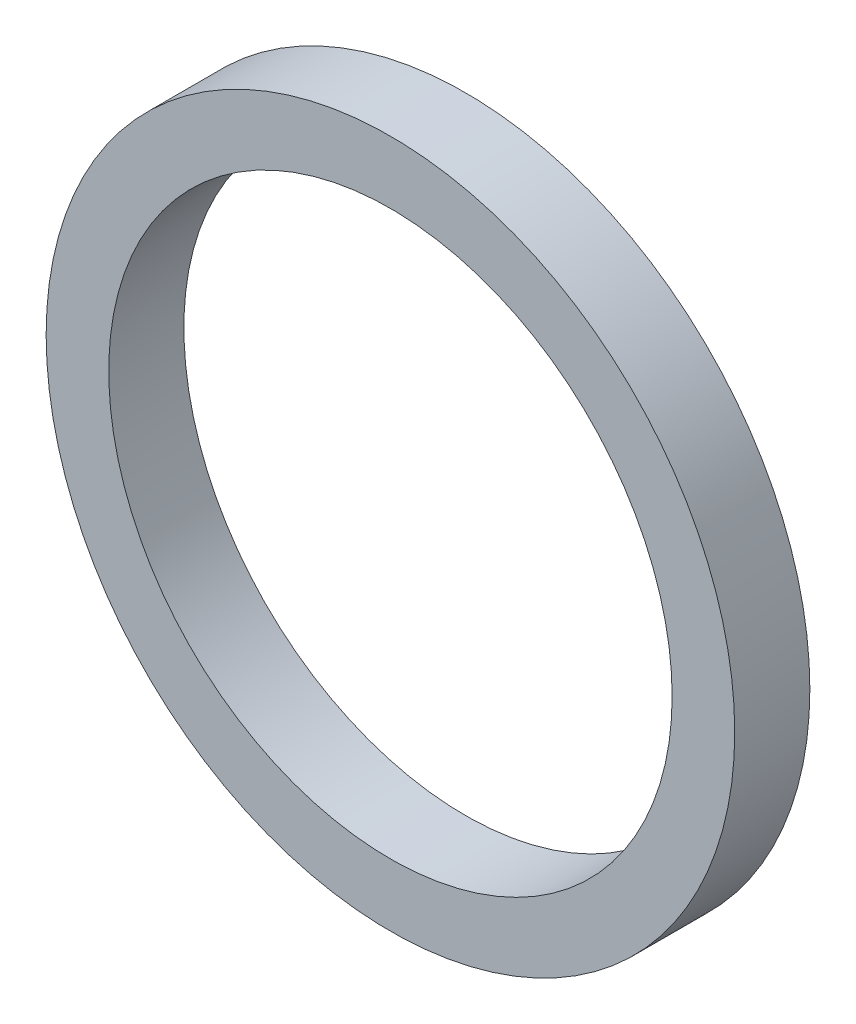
ISO-10303-21;
HEADER;
FILE_DESCRIPTION(('STEP AP214'),'2;1');
FILE_NAME('part.step','',(''),(''),'','','');
FILE_SCHEMA(('AUTOMOTIVE_DESIGN { 1 0 10303 214 1 1 1 1 }'));
ENDSEC;
DATA;
#1=APPLICATION_CONTEXT('core data for automotive mechanical design processes');
#2=APPLICATION_PROTOCOL_DEFINITION('international standard','automotive_design',2000,#1);
#3=PRODUCT_CONTEXT('',#1,'mechanical');
#4=PRODUCT('Part','Part','',(#3));
#5=PRODUCT_RELATED_PRODUCT_CATEGORY('part','',(#4));
#6=PRODUCT_DEFINITION_FORMATION('','',#4);
#7=PRODUCT_DEFINITION_CONTEXT('part definition',#1,'design');
#8=PRODUCT_DEFINITION('design','',#6,#7);
#9=PRODUCT_DEFINITION_SHAPE('','',#8);
#10=(LENGTH_UNIT() NAMED_UNIT(*) SI_UNIT(.MILLI.,.METRE.));
#11=(NAMED_UNIT(*) PLANE_ANGLE_UNIT() SI_UNIT($,.RADIAN.));
#12=(NAMED_UNIT(*) SI_UNIT($,.STERADIAN.) SOLID_ANGLE_UNIT());
#13=UNCERTAINTY_MEASURE_WITH_UNIT(LENGTH_MEASURE(1.E-05),#10,'distance_accuracy_value','');
#14=(GEOMETRIC_REPRESENTATION_CONTEXT(3) GLOBAL_UNCERTAINTY_ASSIGNED_CONTEXT((#13)) GLOBAL_UNIT_ASSIGNED_CONTEXT((#10,
#11,#12)) REPRESENTATION_CONTEXT('',''));
#15=CARTESIAN_POINT('',(0.,0.,0.));
#16=DIRECTION('',(0.,0.,1.));
#17=DIRECTION('',(1.,0.,0.));
#18=AXIS2_PLACEMENT_3D('',#15,#16,#17);
#19=CARTESIAN_POINT('',(0.,0.,0.));
#20=DIRECTION('',(0.,0.,1.));
#21=DIRECTION('',(1.,0.,0.));
#22=AXIS2_PLACEMENT_3D('',#19,#20,#21);
#23=PLANE('',#22);
#24=CARTESIAN_POINT('',(0.,0.,0.));
#25=DIRECTION('',(0.,0.,1.));
#26=DIRECTION('',(1.,0.,0.));
#27=AXIS2_PLACEMENT_3D('',#24,#25,#26);
#28=CIRCLE('',#27,22.5);
#29=CARTESIAN_POINT('',(22.5,0.,0.));
#30=VERTEX_POINT('',#29);
#31=EDGE_CURVE('E18',#30,#30,#28,.T.);
#32=ORIENTED_EDGE('',*,*,#31,.T.);
#33=EDGE_LOOP('',(#32));
#34=FACE_BOUND('',#33,.T.);
#35=CARTESIAN_POINT('',(0.,0.,0.));
#36=DIRECTION('',(0.,0.,1.));
#37=DIRECTION('',(1.,0.,0.));
#38=AXIS2_PLACEMENT_3D('',#35,#36,#37);
#39=CIRCLE('',#38,27.5);
#40=CARTESIAN_POINT('',(27.5,0.,0.));
#41=VERTEX_POINT('',#40);
#42=EDGE_CURVE('E10',#41,#41,#39,.T.);
#43=ORIENTED_EDGE('',*,*,#42,.F.);
#44=EDGE_LOOP('',(#43));
#45=FACE_BOUND('',#44,.T.);
#46=ADVANCED_FACE('F15',(#34,#45),#23,.F.);
#47=CARTESIAN_POINT('',(0.,0.,6.));
#48=DIRECTION('',(0.,0.,1.));
#49=DIRECTION('',(1.,0.,0.));
#50=AXIS2_PLACEMENT_3D('',#47,#48,#49);
#51=PLANE('',#50);
#52=CARTESIAN_POINT('',(0.,0.,6.));
#53=DIRECTION('',(0.,0.,1.));
#54=DIRECTION('',(1.,0.,0.));
#55=AXIS2_PLACEMENT_3D('',#52,#53,#54);
#56=CIRCLE('',#55,22.5);
#57=CARTESIAN_POINT('',(22.5,0.,6.));
#58=VERTEX_POINT('',#57);
#59=EDGE_CURVE('E34',#58,#58,#56,.T.);
#60=ORIENTED_EDGE('',*,*,#59,.F.);
#61=EDGE_LOOP('',(#60));
#62=FACE_BOUND('',#61,.T.);
#63=CARTESIAN_POINT('',(0.,0.,6.));
#64=DIRECTION('',(0.,0.,1.));
#65=DIRECTION('',(1.,0.,0.));
#66=AXIS2_PLACEMENT_3D('',#63,#64,#65);
#67=CIRCLE('',#66,27.5);
#68=CARTESIAN_POINT('',(27.5,0.,6.));
#69=VERTEX_POINT('',#68);
#70=EDGE_CURVE('E23',#69,#69,#67,.T.);
#71=ORIENTED_EDGE('',*,*,#70,.T.);
#72=EDGE_LOOP('',(#71));
#73=FACE_BOUND('',#72,.T.);
#74=ADVANCED_FACE('F57',(#62,#73),#51,.T.);
#75=CARTESIAN_POINT('',(0.,0.,6.));
#76=DIRECTION('',(0.,0.,-1.));
#77=DIRECTION('',(-1.,0.,0.));
#78=AXIS2_PLACEMENT_3D('',#75,#76,#77);
#79=CYLINDRICAL_SURFACE('',#78,27.5);
#80=ORIENTED_EDGE('',*,*,#42,.T.);
#81=EDGE_LOOP('',(#80));
#82=FACE_BOUND('',#81,.T.);
#83=ORIENTED_EDGE('',*,*,#70,.F.);
#84=EDGE_LOOP('',(#83));
#85=FACE_BOUND('',#84,.T.);
#86=ADVANCED_FACE('F51',(#82,#85),#79,.T.);
#87=CARTESIAN_POINT('',(0.,0.,6.));
#88=DIRECTION('',(0.,0.,-1.));
#89=DIRECTION('',(-1.,0.,0.));
#90=AXIS2_PLACEMENT_3D('',#87,#88,#89);
#91=CYLINDRICAL_SURFACE('',#90,22.5);
#92=ORIENTED_EDGE('',*,*,#31,.F.);
#93=EDGE_LOOP('',(#92));
#94=FACE_BOUND('',#93,.T.);
#95=ORIENTED_EDGE('',*,*,#59,.T.);
#96=EDGE_LOOP('',(#95));
#97=FACE_BOUND('',#96,.T.);
#98=ADVANCED_FACE('F49',(#94,#97),#91,.F.);
#99=CLOSED_SHELL('',(#46,#74,#86,#98));
#100=MANIFOLD_SOLID_BREP('B1',#99);
#101=ADVANCED_BREP_SHAPE_REPRESENTATION('',(#18,#100),#14);
#102=SHAPE_DEFINITION_REPRESENTATION(#9,#101);
ENDSEC;
END-ISO-10303-21;
